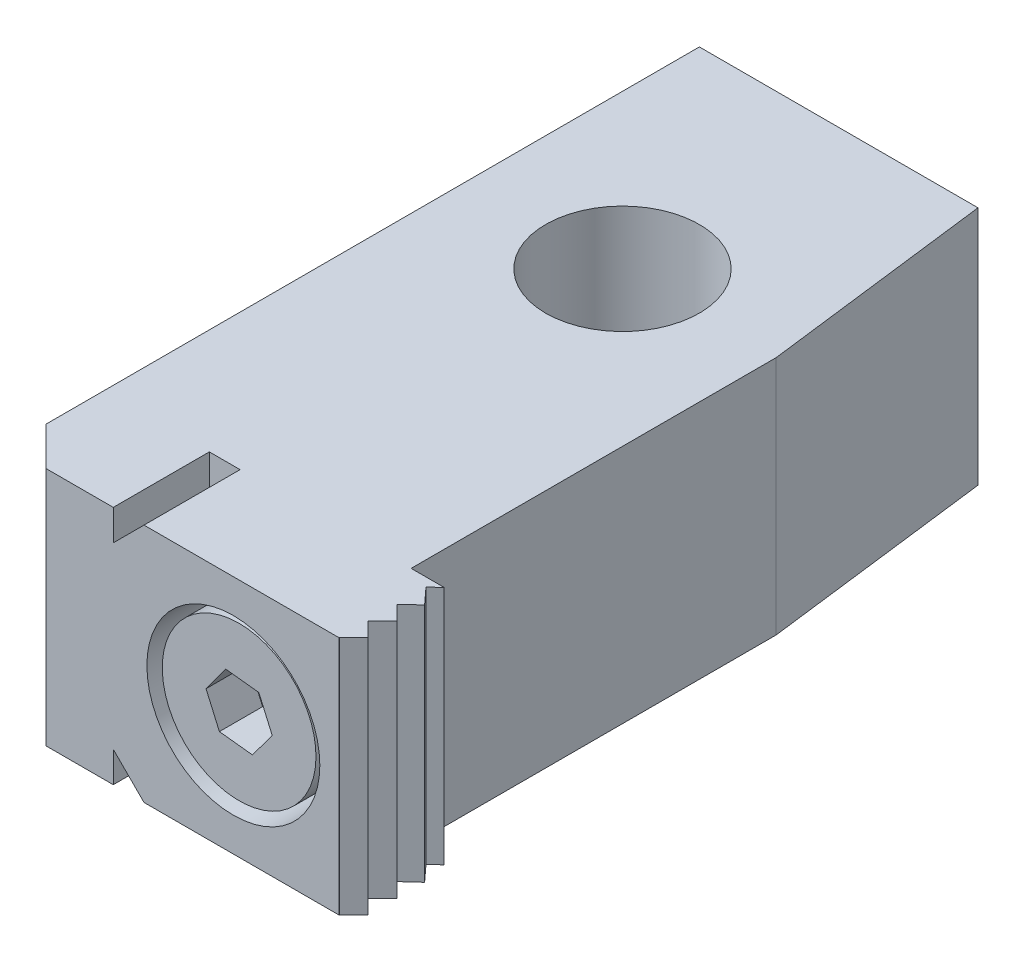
ISO-10303-21;
HEADER;
FILE_DESCRIPTION(('STEP AP214'),'2;1');
FILE_NAME('part.step','',(''),(''),'','','');
FILE_SCHEMA(('AUTOMOTIVE_DESIGN { 1 0 10303 214 1 1 1 1 }'));
ENDSEC;
DATA;
#1=APPLICATION_CONTEXT('core data for automotive mechanical design processes');
#2=APPLICATION_PROTOCOL_DEFINITION('international standard','automotive_design',2000,#1);
#3=PRODUCT_CONTEXT('',#1,'mechanical');
#4=PRODUCT('Part','Part','',(#3));
#5=PRODUCT_RELATED_PRODUCT_CATEGORY('part','',(#4));
#6=PRODUCT_DEFINITION_FORMATION('','',#4);
#7=PRODUCT_DEFINITION_CONTEXT('part definition',#1,'design');
#8=PRODUCT_DEFINITION('design','',#6,#7);
#9=PRODUCT_DEFINITION_SHAPE('','',#8);
#10=(LENGTH_UNIT() NAMED_UNIT(*) SI_UNIT(.MILLI.,.METRE.));
#11=(NAMED_UNIT(*) PLANE_ANGLE_UNIT() SI_UNIT($,.RADIAN.));
#12=(NAMED_UNIT(*) SI_UNIT($,.STERADIAN.) SOLID_ANGLE_UNIT());
#13=UNCERTAINTY_MEASURE_WITH_UNIT(LENGTH_MEASURE(1.E-05),#10,'distance_accuracy_value','');
#14=(GEOMETRIC_REPRESENTATION_CONTEXT(3) GLOBAL_UNCERTAINTY_ASSIGNED_CONTEXT((#13)) GLOBAL_UNIT_ASSIGNED_CONTEXT((#10,
#11,#12)) REPRESENTATION_CONTEXT('',''));
#15=CARTESIAN_POINT('',(0.,0.,0.));
#16=DIRECTION('',(0.,0.,1.));
#17=DIRECTION('',(1.,0.,0.));
#18=AXIS2_PLACEMENT_3D('',#15,#16,#17);
#19=CARTESIAN_POINT('',(8.38549232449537,7.9508429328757,47.4));
#20=DIRECTION('',(0.,0.,1.));
#21=DIRECTION('',(0.110686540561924,0.993855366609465,0.));
#22=AXIS2_PLACEMENT_3D('',#19,#20,#21);
#23=PLANE('',#22);
#24=DIRECTION('',(-0.592785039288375,-0.805360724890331,0.));
#25=VECTOR('',#24,1.);
#26=CARTESIAN_POINT('',(6.11065163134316,3.17328081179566,47.4));
#27=LINE('',#26,#25);
#28=CARTESIAN_POINT('',(6.11065163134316,3.17328081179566,47.4));
#29=VERTEX_POINT('',#28);
#30=CARTESIAN_POINT('',(4.05718401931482,0.38342942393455,47.4));
#31=VERTEX_POINT('',#30);
#32=EDGE_CURVE('E35',#29,#31,#27,.T.);
#33=ORIENTED_EDGE('',*,*,#32,.F.);
#34=DIRECTION('',(-0.993855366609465,0.110686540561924,0.));
#35=VECTOR('',#34,1.);
#36=CARTESIAN_POINT('',(9.55346761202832,2.78985138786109,47.4));
#37=LINE('',#36,#35);
#38=CARTESIAN_POINT('',(9.55346761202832,2.78985138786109,47.4));
#39=VERTEX_POINT('',#38);
#40=EDGE_CURVE('E588',#39,#29,#37,.T.);
#41=ORIENTED_EDGE('',*,*,#40,.F.);
#42=DIRECTION('',(-0.401070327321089,0.916047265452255,0.));
#43=VECTOR('',#42,1.);
#44=CARTESIAN_POINT('',(10.9428159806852,-0.383429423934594,47.4));
#45=LINE('',#44,#43);
#46=CARTESIAN_POINT('',(10.9428159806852,-0.383429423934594,47.4));
#47=VERTEX_POINT('',#46);
#48=EDGE_CURVE('E591',#47,#39,#45,.T.);
#49=ORIENTED_EDGE('',*,*,#48,.F.);
#50=DIRECTION('',(0.592785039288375,0.805360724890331,0.));
#51=VECTOR('',#50,1.);
#52=CARTESIAN_POINT('',(8.88934836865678,-3.1732808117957,47.4));
#53=LINE('',#52,#51);
#54=CARTESIAN_POINT('',(8.88934836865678,-3.1732808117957,47.4));
#55=VERTEX_POINT('',#54);
#56=EDGE_CURVE('E594',#55,#47,#53,.T.);
#57=ORIENTED_EDGE('',*,*,#56,.F.);
#58=DIRECTION('',(0.993855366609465,-0.110686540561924,0.));
#59=VECTOR('',#58,1.);
#60=CARTESIAN_POINT('',(5.4465323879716,-2.78985138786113,47.4));
#61=LINE('',#60,#59);
#62=CARTESIAN_POINT('',(5.4465323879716,-2.78985138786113,47.4));
#63=VERTEX_POINT('',#62);
#64=EDGE_CURVE('E597',#63,#55,#61,.T.);
#65=ORIENTED_EDGE('',*,*,#64,.F.);
#66=DIRECTION('',(0.401070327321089,-0.916047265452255,0.));
#67=VECTOR('',#66,1.);
#68=CARTESIAN_POINT('',(4.05718401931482,0.38342942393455,47.4));
#69=LINE('',#68,#67);
#70=EDGE_CURVE('E600',#31,#63,#69,.T.);
#71=ORIENTED_EDGE('',*,*,#70,.F.);
#72=EDGE_LOOP('',(#33,#41,#49,#57,#65,#71));
#73=FACE_BOUND('',#72,.T.);
#74=CARTESIAN_POINT('',(7.5,0.,47.4));
#75=DIRECTION('',(0.,0.,1.));
#76=DIRECTION('',(0.110686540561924,0.993855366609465,0.));
#77=AXIS2_PLACEMENT_3D('',#74,#75,#76);
#78=CIRCLE('',#77,8.);
#79=CARTESIAN_POINT('',(8.38549232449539,7.9508429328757,47.4));
#80=VERTEX_POINT('',#79);
#81=EDGE_CURVE('E541',#80,#80,#78,.T.);
#82=ORIENTED_EDGE('',*,*,#81,.T.);
#83=EDGE_LOOP('',(#82));
#84=FACE_BOUND('',#83,.T.);
#85=ADVANCED_FACE('F15',(#73,#84),#23,.T.);
#86=CARTESIAN_POINT('',(7.5,0.,41.4));
#87=DIRECTION('',(0.,0.,1.));
#88=DIRECTION('',(0.110686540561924,0.993855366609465,0.));
#89=AXIS2_PLACEMENT_3D('',#86,#87,#88);
#90=CYLINDRICAL_SURFACE('',#89,8.);
#91=CARTESIAN_POINT('',(7.5,0.,41.4));
#92=DIRECTION('',(0.,0.,1.));
#93=DIRECTION('',(0.110686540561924,0.993855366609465,0.));
#94=AXIS2_PLACEMENT_3D('',#91,#92,#93);
#95=CIRCLE('',#94,8.);
#96=CARTESIAN_POINT('',(8.38549232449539,7.9508429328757,41.4));
#97=VERTEX_POINT('',#96);
#98=EDGE_CURVE('E543',#97,#97,#95,.T.);
#99=ORIENTED_EDGE('',*,*,#98,.T.);
#100=EDGE_LOOP('',(#99));
#101=FACE_BOUND('',#100,.T.);
#102=ORIENTED_EDGE('',*,*,#81,.F.);
#103=EDGE_LOOP('',(#102));
#104=FACE_BOUND('',#103,.T.);
#105=ADVANCED_FACE('F452',(#101,#104),#90,.T.);
#106=CARTESIAN_POINT('',(6.11065163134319,3.17328081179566,42.9));
#107=DIRECTION('',(-0.805360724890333,0.592785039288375,0.));
#108=DIRECTION('',(-0.592785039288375,-0.805360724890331,0.));
#109=AXIS2_PLACEMENT_3D('',#106,#107,#108);
#110=PLANE('',#109);
#111=ORIENTED_EDGE('',*,*,#32,.T.);
#112=DIRECTION('',(0.,0.,1.));
#113=VECTOR('',#112,1.);
#114=CARTESIAN_POINT('',(4.05718401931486,0.383429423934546,42.9));
#115=LINE('',#114,#113);
#116=CARTESIAN_POINT('',(4.05718401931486,0.383429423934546,42.9));
#117=VERTEX_POINT('',#116);
#118=EDGE_CURVE('E555',#117,#31,#115,.T.);
#119=ORIENTED_EDGE('',*,*,#118,.F.);
#120=DIRECTION('',(-0.592785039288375,-0.805360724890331,0.));
#121=VECTOR('',#120,1.);
#122=CARTESIAN_POINT('',(6.11065163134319,3.17328081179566,42.9));
#123=LINE('',#122,#121);
#124=CARTESIAN_POINT('',(6.11065163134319,3.17328081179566,42.9));
#125=VERTEX_POINT('',#124);
#126=EDGE_CURVE('E585',#125,#117,#123,.T.);
#127=ORIENTED_EDGE('',*,*,#126,.F.);
#128=DIRECTION('',(0.,0.,1.));
#129=VECTOR('',#128,1.);
#130=CARTESIAN_POINT('',(6.11065163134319,3.17328081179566,42.9));
#131=LINE('',#130,#129);
#132=EDGE_CURVE('E554',#125,#29,#131,.T.);
#133=ORIENTED_EDGE('',*,*,#132,.T.);
#134=EDGE_LOOP('',(#111,#119,#127,#133));
#135=FACE_BOUND('',#134,.T.);
#136=ADVANCED_FACE('F459',(#135),#110,.F.);
#137=CARTESIAN_POINT('',(9.55346761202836,2.78985138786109,42.9));
#138=DIRECTION('',(0.110686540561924,0.993855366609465,0.));
#139=DIRECTION('',(-0.993855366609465,0.110686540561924,0.));
#140=AXIS2_PLACEMENT_3D('',#137,#138,#139);
#141=PLANE('',#140);
#142=ORIENTED_EDGE('',*,*,#40,.T.);
#143=ORIENTED_EDGE('',*,*,#132,.F.);
#144=DIRECTION('',(-0.993855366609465,0.110686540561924,0.));
#145=VECTOR('',#144,1.);
#146=CARTESIAN_POINT('',(9.55346761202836,2.78985138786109,42.9));
#147=LINE('',#146,#145);
#148=CARTESIAN_POINT('',(9.55346761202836,2.78985138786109,42.9));
#149=VERTEX_POINT('',#148);
#150=EDGE_CURVE('E558',#149,#125,#147,.T.);
#151=ORIENTED_EDGE('',*,*,#150,.F.);
#152=DIRECTION('',(0.,0.,1.));
#153=VECTOR('',#152,1.);
#154=CARTESIAN_POINT('',(9.55346761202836,2.78985138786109,42.9));
#155=LINE('',#154,#153);
#156=EDGE_CURVE('E567',#149,#39,#155,.T.);
#157=ORIENTED_EDGE('',*,*,#156,.T.);
#158=EDGE_LOOP('',(#142,#143,#151,#157));
#159=FACE_BOUND('',#158,.T.);
#160=ADVANCED_FACE('F643',(#159),#141,.F.);
#161=CARTESIAN_POINT('',(10.9428159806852,-0.383429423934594,42.9));
#162=DIRECTION('',(0.916047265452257,0.401070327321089,0.));
#163=DIRECTION('',(-0.401070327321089,0.916047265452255,0.));
#164=AXIS2_PLACEMENT_3D('',#161,#162,#163);
#165=PLANE('',#164);
#166=ORIENTED_EDGE('',*,*,#48,.T.);
#167=ORIENTED_EDGE('',*,*,#156,.F.);
#168=DIRECTION('',(-0.401070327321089,0.916047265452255,0.));
#169=VECTOR('',#168,1.);
#170=CARTESIAN_POINT('',(10.9428159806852,-0.383429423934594,42.9));
#171=LINE('',#170,#169);
#172=CARTESIAN_POINT('',(10.9428159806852,-0.383429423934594,42.9));
#173=VERTEX_POINT('',#172);
#174=EDGE_CURVE('E573',#173,#149,#171,.T.);
#175=ORIENTED_EDGE('',*,*,#174,.F.);
#176=DIRECTION('',(0.,0.,1.));
#177=VECTOR('',#176,1.);
#178=CARTESIAN_POINT('',(10.9428159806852,-0.383429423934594,42.9));
#179=LINE('',#178,#177);
#180=EDGE_CURVE('E564',#173,#47,#179,.T.);
#181=ORIENTED_EDGE('',*,*,#180,.T.);
#182=EDGE_LOOP('',(#166,#167,#175,#181));
#183=FACE_BOUND('',#182,.T.);
#184=ADVANCED_FACE('F638',(#183),#165,.F.);
#185=CARTESIAN_POINT('',(8.8893483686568,-3.1732808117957,42.9));
#186=DIRECTION('',(0.805360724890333,-0.592785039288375,0.));
#187=DIRECTION('',(0.592785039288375,0.805360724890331,0.));
#188=AXIS2_PLACEMENT_3D('',#185,#186,#187);
#189=PLANE('',#188);
#190=ORIENTED_EDGE('',*,*,#56,.T.);
#191=ORIENTED_EDGE('',*,*,#180,.F.);
#192=DIRECTION('',(0.592785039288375,0.805360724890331,0.));
#193=VECTOR('',#192,1.);
#194=CARTESIAN_POINT('',(8.8893483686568,-3.1732808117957,42.9));
#195=LINE('',#194,#193);
#196=CARTESIAN_POINT('',(8.8893483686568,-3.1732808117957,42.9));
#197=VERTEX_POINT('',#196);
#198=EDGE_CURVE('E576',#197,#173,#195,.T.);
#199=ORIENTED_EDGE('',*,*,#198,.F.);
#200=DIRECTION('',(0.,0.,1.));
#201=VECTOR('',#200,1.);
#202=CARTESIAN_POINT('',(8.8893483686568,-3.1732808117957,42.9));
#203=LINE('',#202,#201);
#204=EDGE_CURVE('E561',#197,#55,#203,.T.);
#205=ORIENTED_EDGE('',*,*,#204,.T.);
#206=EDGE_LOOP('',(#190,#191,#199,#205));
#207=FACE_BOUND('',#206,.T.);
#208=ADVANCED_FACE('F851',(#207),#189,.F.);
#209=CARTESIAN_POINT('',(5.44653238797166,-2.78985138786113,42.9));
#210=DIRECTION('',(-0.110686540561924,-0.993855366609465,0.));
#211=DIRECTION('',(0.,0.,1.));
#212=AXIS2_PLACEMENT_3D('',#209,#210,#211);
#213=PLANE('',#212);
#214=ORIENTED_EDGE('',*,*,#64,.T.);
#215=ORIENTED_EDGE('',*,*,#204,.F.);
#216=DIRECTION('',(0.993855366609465,-0.110686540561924,0.));
#217=VECTOR('',#216,1.);
#218=CARTESIAN_POINT('',(5.44653238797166,-2.78985138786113,42.9));
#219=LINE('',#218,#217);
#220=CARTESIAN_POINT('',(5.44653238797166,-2.78985138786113,42.9));
#221=VERTEX_POINT('',#220);
#222=EDGE_CURVE('E579',#221,#197,#219,.T.);
#223=ORIENTED_EDGE('',*,*,#222,.F.);
#224=DIRECTION('',(0.,0.,1.));
#225=VECTOR('',#224,1.);
#226=CARTESIAN_POINT('',(5.44653238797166,-2.78985138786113,42.9));
#227=LINE('',#226,#225);
#228=EDGE_CURVE('E557',#221,#63,#227,.T.);
#229=ORIENTED_EDGE('',*,*,#228,.T.);
#230=EDGE_LOOP('',(#214,#215,#223,#229));
#231=FACE_BOUND('',#230,.T.);
#232=ADVANCED_FACE('F617',(#231),#213,.F.);
#233=CARTESIAN_POINT('',(4.05718401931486,0.383429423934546,42.9));
#234=DIRECTION('',(-0.916047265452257,-0.401070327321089,0.));
#235=DIRECTION('',(0.401070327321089,-0.916047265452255,0.));
#236=AXIS2_PLACEMENT_3D('',#233,#234,#235);
#237=PLANE('',#236);
#238=ORIENTED_EDGE('',*,*,#70,.T.);
#239=ORIENTED_EDGE('',*,*,#228,.F.);
#240=DIRECTION('',(0.401070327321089,-0.916047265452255,0.));
#241=VECTOR('',#240,1.);
#242=CARTESIAN_POINT('',(4.05718401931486,0.383429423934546,42.9));
#243=LINE('',#242,#241);
#244=EDGE_CURVE('E582',#117,#221,#243,.T.);
#245=ORIENTED_EDGE('',*,*,#244,.F.);
#246=ORIENTED_EDGE('',*,*,#118,.T.);
#247=EDGE_LOOP('',(#238,#239,#245,#246));
#248=FACE_BOUND('',#247,.T.);
#249=ADVANCED_FACE('F607',(#248),#237,.F.);
#250=CARTESIAN_POINT('',(8.16411924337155,5.96313219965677,42.9));
#251=DIRECTION('',(0.,0.,-1.));
#252=DIRECTION('',(-0.110686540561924,-0.993855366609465,0.));
#253=AXIS2_PLACEMENT_3D('',#250,#251,#252);
#254=PLANE('',#253);
#255=ORIENTED_EDGE('',*,*,#126,.T.);
#256=ORIENTED_EDGE('',*,*,#244,.T.);
#257=ORIENTED_EDGE('',*,*,#222,.T.);
#258=ORIENTED_EDGE('',*,*,#198,.T.);
#259=ORIENTED_EDGE('',*,*,#174,.T.);
#260=ORIENTED_EDGE('',*,*,#150,.T.);
#261=EDGE_LOOP('',(#255,#256,#257,#258,#259,#260));
#262=FACE_BOUND('',#261,.T.);
#263=ADVANCED_FACE('F448',(#262),#254,.F.);
#264=CARTESIAN_POINT('',(0.,-12.5,0.));
#265=DIRECTION('',(0.,1.,0.));
#266=DIRECTION('',(0.,0.,-1.));
#267=AXIS2_PLACEMENT_3D('',#264,#265,#266);
#268=CYLINDRICAL_SURFACE('',#267,8.);
#269=CARTESIAN_POINT('',(0.,-12.5,0.));
#270=DIRECTION('',(0.,-1.,0.));
#271=DIRECTION('',(0.,0.,1.));
#272=AXIS2_PLACEMENT_3D('',#269,#270,#271);
#273=CIRCLE('',#272,8.);
#274=CARTESIAN_POINT('',(0.,-12.5,8.));
#275=VERTEX_POINT('',#274);
#276=EDGE_CURVE('E356',#275,#275,#273,.T.);
#277=ORIENTED_EDGE('',*,*,#276,.T.);
#278=EDGE_LOOP('',(#277));
#279=FACE_BOUND('',#278,.T.);
#280=CARTESIAN_POINT('',(0.,12.5,0.));
#281=DIRECTION('',(0.,-1.,0.));
#282=DIRECTION('',(0.,0.,1.));
#283=AXIS2_PLACEMENT_3D('',#280,#281,#282);
#284=CIRCLE('',#283,8.);
#285=CARTESIAN_POINT('',(0.,12.5,8.));
#286=VERTEX_POINT('',#285);
#287=EDGE_CURVE('E352',#286,#286,#284,.T.);
#288=ORIENTED_EDGE('',*,*,#287,.F.);
#289=EDGE_LOOP('',(#288));
#290=FACE_BOUND('',#289,.T.);
#291=ADVANCED_FACE('F442',(#279,#290),#268,.F.);
#292=CARTESIAN_POINT('',(-16.,-12.5,-24.));
#293=DIRECTION('',(1.,0.,0.));
#294=DIRECTION('',(0.,0.,1.));
#295=AXIS2_PLACEMENT_3D('',#292,#293,#294);
#296=PLANE('',#295);
#297=DIRECTION('',(0.,0.,-1.));
#298=VECTOR('',#297,1.);
#299=CARTESIAN_POINT('',(-16.,-12.5,-24.));
#300=LINE('',#299,#298);
#301=CARTESIAN_POINT('',(-16.,-12.5,44.));
#302=VERTEX_POINT('',#301);
#303=CARTESIAN_POINT('',(-16.,-12.5,-24.));
#304=VERTEX_POINT('',#303);
#305=EDGE_CURVE('E201',#302,#304,#300,.T.);
#306=ORIENTED_EDGE('',*,*,#305,.F.);
#307=DIRECTION('',(0.,1.,0.));
#308=VECTOR('',#307,1.);
#309=CARTESIAN_POINT('',(-16.,-12.5,44.));
#310=LINE('',#309,#308);
#311=CARTESIAN_POINT('',(-16.,12.5,44.));
#312=VERTEX_POINT('',#311);
#313=EDGE_CURVE('E205',#302,#312,#310,.T.);
#314=ORIENTED_EDGE('',*,*,#313,.T.);
#315=DIRECTION('',(0.,0.,-1.));
#316=VECTOR('',#315,1.);
#317=CARTESIAN_POINT('',(-16.,12.5,-24.));
#318=LINE('',#317,#316);
#319=CARTESIAN_POINT('',(-16.,12.5,-24.));
#320=VERTEX_POINT('',#319);
#321=EDGE_CURVE('E364',#312,#320,#318,.T.);
#322=ORIENTED_EDGE('',*,*,#321,.T.);
#323=DIRECTION('',(0.,1.,0.));
#324=VECTOR('',#323,1.);
#325=CARTESIAN_POINT('',(-16.,-12.5,-24.));
#326=LINE('',#325,#324);
#327=EDGE_CURVE('E203',#304,#320,#326,.T.);
#328=ORIENTED_EDGE('',*,*,#327,.F.);
#329=EDGE_LOOP('',(#306,#314,#322,#328));
#330=FACE_BOUND('',#329,.T.);
#331=ADVANCED_FACE('F376',(#330),#296,.F.);
#332=CARTESIAN_POINT('',(16.,-12.5,-24.));
#333=DIRECTION('',(0.,0.,1.));
#334=DIRECTION('',(-1.,0.,0.));
#335=AXIS2_PLACEMENT_3D('',#332,#333,#334);
#336=PLANE('',#335);
#337=DIRECTION('',(1.,0.,0.));
#338=VECTOR('',#337,1.);
#339=CARTESIAN_POINT('',(16.,12.5,-24.));
#340=LINE('',#339,#338);
#341=CARTESIAN_POINT('',(13.,12.5,-24.));
#342=VERTEX_POINT('',#341);
#343=EDGE_CURVE('E194',#320,#342,#340,.T.);
#344=ORIENTED_EDGE('',*,*,#343,.T.);
#345=DIRECTION('',(0.,-1.,0.));
#346=VECTOR('',#345,1.);
#347=CARTESIAN_POINT('',(13.,12.5,-24.));
#348=LINE('',#347,#346);
#349=CARTESIAN_POINT('',(13.,-12.5,-24.));
#350=VERTEX_POINT('',#349);
#351=EDGE_CURVE('E176',#342,#350,#348,.T.);
#352=ORIENTED_EDGE('',*,*,#351,.T.);
#353=DIRECTION('',(1.,0.,0.));
#354=VECTOR('',#353,1.);
#355=CARTESIAN_POINT('',(16.,-12.5,-24.));
#356=LINE('',#355,#354);
#357=EDGE_CURVE('E192',#304,#350,#356,.T.);
#358=ORIENTED_EDGE('',*,*,#357,.F.);
#359=ORIENTED_EDGE('',*,*,#327,.T.);
#360=EDGE_LOOP('',(#344,#352,#358,#359));
#361=FACE_BOUND('',#360,.T.);
#362=ADVANCED_FACE('F190',(#361),#336,.F.);
#363=CARTESIAN_POINT('',(13.,12.5,-24.));
#364=DIRECTION('',(-0.992277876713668,0.,0.124034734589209));
#365=DIRECTION('',(-0.124034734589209,0.,-0.992277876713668));
#366=AXIS2_PLACEMENT_3D('',#363,#364,#365);
#367=PLANE('',#366);
#368=DIRECTION('',(-0.124034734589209,0.,-0.992277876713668));
#369=VECTOR('',#368,1.);
#370=CARTESIAN_POINT('',(13.,-12.5,-24.));
#371=LINE('',#370,#369);
#372=CARTESIAN_POINT('',(16.,-12.5,0.));
#373=VERTEX_POINT('',#372);
#374=EDGE_CURVE('E173',#373,#350,#371,.T.);
#375=ORIENTED_EDGE('',*,*,#374,.T.);
#376=ORIENTED_EDGE('',*,*,#351,.F.);
#377=DIRECTION('',(-0.124034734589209,0.,-0.992277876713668));
#378=VECTOR('',#377,1.);
#379=CARTESIAN_POINT('',(13.,12.5,-24.));
#380=LINE('',#379,#378);
#381=CARTESIAN_POINT('',(16.,12.5,0.));
#382=VERTEX_POINT('',#381);
#383=EDGE_CURVE('E184',#382,#342,#380,.T.);
#384=ORIENTED_EDGE('',*,*,#383,.F.);
#385=DIRECTION('',(0.,-1.,0.));
#386=VECTOR('',#385,1.);
#387=CARTESIAN_POINT('',(16.,12.5,0.));
#388=LINE('',#387,#386);
#389=EDGE_CURVE('E179',#382,#373,#388,.T.);
#390=ORIENTED_EDGE('',*,*,#389,.T.);
#391=EDGE_LOOP('',(#375,#376,#384,#390));
#392=FACE_BOUND('',#391,.T.);
#393=ADVANCED_FACE('F175',(#392),#367,.F.);
#394=CARTESIAN_POINT('',(16.,-12.5,-24.));
#395=DIRECTION('',(-1.,0.,0.));
#396=DIRECTION('',(0.,0.,-1.));
#397=AXIS2_PLACEMENT_3D('',#394,#395,#396);
#398=PLANE('',#397);
#399=DIRECTION('',(0.,0.,1.));
#400=VECTOR('',#399,1.);
#401=CARTESIAN_POINT('',(16.,-12.5,-24.));
#402=LINE('',#401,#400);
#403=CARTESIAN_POINT('',(16.,-12.5,38.));
#404=VERTEX_POINT('',#403);
#405=EDGE_CURVE('E367',#373,#404,#402,.T.);
#406=ORIENTED_EDGE('',*,*,#405,.F.);
#407=ORIENTED_EDGE('',*,*,#389,.F.);
#408=DIRECTION('',(0.,0.,1.));
#409=VECTOR('',#408,1.);
#410=CARTESIAN_POINT('',(16.,12.5,-24.));
#411=LINE('',#410,#409);
#412=CARTESIAN_POINT('',(16.,12.5,38.));
#413=VERTEX_POINT('',#412);
#414=EDGE_CURVE('E359',#382,#413,#411,.T.);
#415=ORIENTED_EDGE('',*,*,#414,.T.);
#416=DIRECTION('',(0.,1.,0.));
#417=VECTOR('',#416,1.);
#418=CARTESIAN_POINT('',(16.,-12.5,38.));
#419=LINE('',#418,#417);
#420=EDGE_CURVE('E324',#404,#413,#419,.T.);
#421=ORIENTED_EDGE('',*,*,#420,.F.);
#422=EDGE_LOOP('',(#406,#407,#415,#421));
#423=FACE_BOUND('',#422,.T.);
#424=ADVANCED_FACE('F17',(#423),#398,.F.);
#425=CARTESIAN_POINT('',(16.,12.5,38.));
#426=DIRECTION('',(0.,0.,1.));
#427=DIRECTION('',(-1.,0.,0.));
#428=AXIS2_PLACEMENT_3D('',#425,#426,#427);
#429=PLANE('',#428);
#430=DIRECTION('',(0.70710678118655,-0.707106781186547,0.));
#431=VECTOR('',#430,1.);
#432=CARTESIAN_POINT('',(-1.8,-12.5,38.));
#433=LINE('',#432,#431);
#434=CARTESIAN_POINT('',(-5.,-9.3,38.));
#435=VERTEX_POINT('',#434);
#436=CARTESIAN_POINT('',(-1.8,-12.5,38.));
#437=VERTEX_POINT('',#436);
#438=EDGE_CURVE('E301',#435,#437,#433,.T.);
#439=ORIENTED_EDGE('',*,*,#438,.F.);
#440=DIRECTION('',(0.,-1.,0.));
#441=VECTOR('',#440,1.);
#442=CARTESIAN_POINT('',(-5.,-12.5,38.));
#443=LINE('',#442,#441);
#444=CARTESIAN_POINT('',(-5.,-12.5,38.));
#445=VERTEX_POINT('',#444);
#446=EDGE_CURVE('E341',#435,#445,#443,.T.);
#447=ORIENTED_EDGE('',*,*,#446,.T.);
#448=DIRECTION('',(1.,0.,0.));
#449=VECTOR('',#448,1.);
#450=CARTESIAN_POINT('',(16.,-12.5,38.));
#451=LINE('',#450,#449);
#452=EDGE_CURVE('E345',#445,#437,#451,.T.);
#453=ORIENTED_EDGE('',*,*,#452,.T.);
#454=EDGE_LOOP('',(#439,#447,#453));
#455=FACE_BOUND('',#454,.T.);
#456=ADVANCED_FACE('F427',(#455),#429,.T.);
#457=CARTESIAN_POINT('',(-5.,-12.5,38.));
#458=DIRECTION('',(-1.,0.,0.));
#459=DIRECTION('',(0.,-1.,0.));
#460=AXIS2_PLACEMENT_3D('',#457,#458,#459);
#461=PLANE('',#460);
#462=ORIENTED_EDGE('',*,*,#446,.F.);
#463=DIRECTION('',(0.,0.,-1.));
#464=VECTOR('',#463,1.);
#465=CARTESIAN_POINT('',(-5.,-9.3,48.));
#466=LINE('',#465,#464);
#467=CARTESIAN_POINT('',(-5.,-9.3,48.));
#468=VERTEX_POINT('',#467);
#469=EDGE_CURVE('E317',#468,#435,#466,.T.);
#470=ORIENTED_EDGE('',*,*,#469,.F.);
#471=DIRECTION('',(0.,-1.,0.));
#472=VECTOR('',#471,1.);
#473=CARTESIAN_POINT('',(-5.,-12.5,48.));
#474=LINE('',#473,#472);
#475=CARTESIAN_POINT('',(-5.,-12.5,48.));
#476=VERTEX_POINT('',#475);
#477=EDGE_CURVE('E195',#468,#476,#474,.T.);
#478=ORIENTED_EDGE('',*,*,#477,.T.);
#479=DIRECTION('',(0.,0.,1.));
#480=VECTOR('',#479,1.);
#481=CARTESIAN_POINT('',(-5.,-12.5,38.));
#482=LINE('',#481,#480);
#483=EDGE_CURVE('E349',#445,#476,#482,.T.);
#484=ORIENTED_EDGE('',*,*,#483,.F.);
#485=EDGE_LOOP('',(#462,#470,#478,#484));
#486=FACE_BOUND('',#485,.T.);
#487=ADVANCED_FACE('F430',(#486),#461,.F.);
#488=CARTESIAN_POINT('',(-16.,-12.5,44.));
#489=DIRECTION('',(0.707106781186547,0.,-0.707106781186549));
#490=DIRECTION('',(0.707106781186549,0.,0.707106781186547));
#491=AXIS2_PLACEMENT_3D('',#488,#489,#490);
#492=PLANE('',#491);
#493=DIRECTION('',(0.707106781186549,0.,0.707106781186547));
#494=VECTOR('',#493,1.);
#495=CARTESIAN_POINT('',(2.,-12.5,62.));
#496=LINE('',#495,#494);
#497=CARTESIAN_POINT('',(-12.,-12.5,48.));
#498=VERTEX_POINT('',#497);
#499=EDGE_CURVE('E19',#498,#302,#496,.F.);
#500=ORIENTED_EDGE('',*,*,#499,.F.);
#501=DIRECTION('',(0.,-1.,0.));
#502=VECTOR('',#501,1.);
#503=CARTESIAN_POINT('',(-12.,-12.5,48.));
#504=LINE('',#503,#502);
#505=CARTESIAN_POINT('',(-12.,12.5,48.));
#506=VERTEX_POINT('',#505);
#507=EDGE_CURVE('E168',#506,#498,#504,.T.);
#508=ORIENTED_EDGE('',*,*,#507,.F.);
#509=DIRECTION('',(-0.707106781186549,0.,-0.707106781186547));
#510=VECTOR('',#509,1.);
#511=CARTESIAN_POINT('',(-16.,12.5,44.));
#512=LINE('',#511,#510);
#513=EDGE_CURVE('E213',#312,#506,#512,.F.);
#514=ORIENTED_EDGE('',*,*,#513,.F.);
#515=ORIENTED_EDGE('',*,*,#313,.F.);
#516=EDGE_LOOP('',(#500,#508,#514,#515));
#517=FACE_BOUND('',#516,.T.);
#518=ADVANCED_FACE('F373',(#517),#492,.F.);
#519=CARTESIAN_POINT('',(-5.,12.5,48.));
#520=VERTEX_POINT('',#519);
#521=CARTESIAN_POINT('',(-5.,9.3,48.));
#522=VERTEX_POINT('',#521);
#523=EDGE_CURVE('E335',#520,#522,#474,.T.);
#524=ORIENTED_EDGE('',*,*,#523,.T.);
#525=DIRECTION('',(0.,0.,-1.));
#526=VECTOR('',#525,1.);
#527=CARTESIAN_POINT('',(-5.,9.3,48.));
#528=LINE('',#527,#526);
#529=CARTESIAN_POINT('',(-5.,9.3,38.));
#530=VERTEX_POINT('',#529);
#531=EDGE_CURVE('E319',#522,#530,#528,.T.);
#532=ORIENTED_EDGE('',*,*,#531,.T.);
#533=CARTESIAN_POINT('',(-5.,12.5,38.));
#534=VERTEX_POINT('',#533);
#535=EDGE_CURVE('E342',#534,#530,#443,.T.);
#536=ORIENTED_EDGE('',*,*,#535,.F.);
#537=DIRECTION('',(0.,0.,1.));
#538=VECTOR('',#537,1.);
#539=CARTESIAN_POINT('',(-5.,12.5,38.));
#540=LINE('',#539,#538);
#541=EDGE_CURVE('E348',#534,#520,#540,.T.);
#542=ORIENTED_EDGE('',*,*,#541,.T.);
#543=EDGE_LOOP('',(#524,#532,#536,#542));
#544=FACE_BOUND('',#543,.T.);
#545=ADVANCED_FACE('F433',(#544),#461,.F.);
#546=DIRECTION('',(-0.70710678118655,-0.707106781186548,0.));
#547=VECTOR('',#546,1.);
#548=CARTESIAN_POINT('',(-5.,9.3,38.));
#549=LINE('',#548,#547);
#550=CARTESIAN_POINT('',(-1.8,12.5,38.));
#551=VERTEX_POINT('',#550);
#552=EDGE_CURVE('E298',#551,#530,#549,.T.);
#553=ORIENTED_EDGE('',*,*,#552,.F.);
#554=DIRECTION('',(-1.,0.,0.));
#555=VECTOR('',#554,1.);
#556=CARTESIAN_POINT('',(16.,12.5,38.));
#557=LINE('',#556,#555);
#558=EDGE_CURVE('E338',#551,#534,#557,.T.);
#559=ORIENTED_EDGE('',*,*,#558,.T.);
#560=ORIENTED_EDGE('',*,*,#535,.T.);
#561=EDGE_LOOP('',(#553,#559,#560));
#562=FACE_BOUND('',#561,.T.);
#563=ADVANCED_FACE('F434',(#562),#429,.T.);
#564=CARTESIAN_POINT('',(18.5,-12.5,41.9674088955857));
#565=DIRECTION('',(-0.674731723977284,0.,-0.738063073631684));
#566=DIRECTION('',(0.738063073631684,0.,-0.674731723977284));
#567=AXIS2_PLACEMENT_3D('',#564,#565,#566);
#568=PLANE('',#567);
#569=DIRECTION('',(-0.738063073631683,0.,0.674731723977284));
#570=VECTOR('',#569,1.);
#571=CARTESIAN_POINT('',(18.5,12.5,41.9674088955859));
#572=LINE('',#571,#570);
#573=CARTESIAN_POINT('',(20.,12.5,40.5961201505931));
#574=VERTEX_POINT('',#573);
#575=CARTESIAN_POINT('',(18.5,12.5,41.9674088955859));
#576=VERTEX_POINT('',#575);
#577=EDGE_CURVE('E214',#574,#576,#572,.T.);
#578=ORIENTED_EDGE('',*,*,#577,.T.);
#579=DIRECTION('',(0.,1.,0.));
#580=VECTOR('',#579,1.);
#581=CARTESIAN_POINT('',(18.5,-12.5,41.9674088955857));
#582=LINE('',#581,#580);
#583=CARTESIAN_POINT('',(18.5,-12.5,41.9674088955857));
#584=VERTEX_POINT('',#583);
#585=EDGE_CURVE('E267',#584,#576,#582,.T.);
#586=ORIENTED_EDGE('',*,*,#585,.F.);
#587=DIRECTION('',(-0.738063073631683,0.,0.674731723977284));
#588=VECTOR('',#587,1.);
#589=CARTESIAN_POINT('',(18.5,-12.5,41.9674088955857));
#590=LINE('',#589,#588);
#591=CARTESIAN_POINT('',(20.,-12.5,40.5961201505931));
#592=VERTEX_POINT('',#591);
#593=EDGE_CURVE('E243',#592,#584,#590,.T.);
#594=ORIENTED_EDGE('',*,*,#593,.F.);
#595=DIRECTION('',(0.,1.,0.));
#596=VECTOR('',#595,1.);
#597=CARTESIAN_POINT('',(20.,-12.5,40.5961201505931));
#598=LINE('',#597,#596);
#599=EDGE_CURVE('E268',#592,#574,#598,.T.);
#600=ORIENTED_EDGE('',*,*,#599,.T.);
#601=EDGE_LOOP('',(#578,#586,#594,#600));
#602=FACE_BOUND('',#601,.T.);
#603=ADVANCED_FACE('F398',(#602),#568,.F.);
#604=CARTESIAN_POINT('',(20.,-12.5,43.4674088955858));
#605=DIRECTION('',(-0.707106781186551,0.,0.707106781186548));
#606=DIRECTION('',(-0.707106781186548,0.,-0.707106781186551));
#607=AXIS2_PLACEMENT_3D('',#604,#605,#606);
#608=PLANE('',#607);
#609=DIRECTION('',(0.707106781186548,0.,0.707106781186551));
#610=VECTOR('',#609,1.);
#611=CARTESIAN_POINT('',(20.,12.5,43.4674088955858));
#612=LINE('',#611,#610);
#613=CARTESIAN_POINT('',(20.,12.5,43.4674088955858));
#614=VERTEX_POINT('',#613);
#615=EDGE_CURVE('E217',#576,#614,#612,.T.);
#616=ORIENTED_EDGE('',*,*,#615,.T.);
#617=DIRECTION('',(0.,1.,0.));
#618=VECTOR('',#617,1.);
#619=CARTESIAN_POINT('',(20.,-12.5,43.4674088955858));
#620=LINE('',#619,#618);
#621=CARTESIAN_POINT('',(20.,-12.5,43.4674088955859));
#622=VERTEX_POINT('',#621);
#623=EDGE_CURVE('E284',#622,#614,#620,.T.);
#624=ORIENTED_EDGE('',*,*,#623,.F.);
#625=DIRECTION('',(0.707106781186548,0.,0.707106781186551));
#626=VECTOR('',#625,1.);
#627=CARTESIAN_POINT('',(20.,-12.5,43.4674088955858));
#628=LINE('',#627,#626);
#629=EDGE_CURVE('E246',#584,#622,#628,.T.);
#630=ORIENTED_EDGE('',*,*,#629,.F.);
#631=ORIENTED_EDGE('',*,*,#585,.T.);
#632=EDGE_LOOP('',(#616,#624,#630,#631));
#633=FACE_BOUND('',#632,.T.);
#634=ADVANCED_FACE('F401',(#633),#608,.F.);
#635=CARTESIAN_POINT('',(18.5,-12.5,44.9674088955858));
#636=DIRECTION('',(-0.707106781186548,0.,-0.707106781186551));
#637=DIRECTION('',(0.707106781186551,0.,-0.707106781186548));
#638=AXIS2_PLACEMENT_3D('',#635,#636,#637);
#639=PLANE('',#638);
#640=DIRECTION('',(-0.707106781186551,0.,0.707106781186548));
#641=VECTOR('',#640,1.);
#642=CARTESIAN_POINT('',(18.5,12.5,44.9674088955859));
#643=LINE('',#642,#641);
#644=CARTESIAN_POINT('',(18.5,12.5,44.9674088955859));
#645=VERTEX_POINT('',#644);
#646=EDGE_CURVE('E223',#614,#645,#643,.T.);
#647=ORIENTED_EDGE('',*,*,#646,.T.);
#648=DIRECTION('',(0.,1.,0.));
#649=VECTOR('',#648,1.);
#650=CARTESIAN_POINT('',(18.5,-12.5,44.9674088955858));
#651=LINE('',#650,#649);
#652=CARTESIAN_POINT('',(18.5,-12.5,44.9674088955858));
#653=VERTEX_POINT('',#652);
#654=EDGE_CURVE('E282',#653,#645,#651,.T.);
#655=ORIENTED_EDGE('',*,*,#654,.F.);
#656=DIRECTION('',(-0.707106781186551,0.,0.707106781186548));
#657=VECTOR('',#656,1.);
#658=CARTESIAN_POINT('',(18.5,-12.5,44.9674088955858));
#659=LINE('',#658,#657);
#660=EDGE_CURVE('E249',#622,#653,#659,.T.);
#661=ORIENTED_EDGE('',*,*,#660,.F.);
#662=ORIENTED_EDGE('',*,*,#623,.T.);
#663=EDGE_LOOP('',(#647,#655,#661,#662));
#664=FACE_BOUND('',#663,.T.);
#665=ADVANCED_FACE('F404',(#664),#639,.F.);
#666=CARTESIAN_POINT('',(20.,-12.5,46.4674088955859));
#667=DIRECTION('',(-0.70710678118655,0.,0.707106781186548));
#668=DIRECTION('',(-0.707106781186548,0.,-0.70710678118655));
#669=AXIS2_PLACEMENT_3D('',#666,#667,#668);
#670=PLANE('',#669);
#671=DIRECTION('',(0.707106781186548,0.,0.70710678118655));
#672=VECTOR('',#671,1.);
#673=CARTESIAN_POINT('',(20.,12.5,46.4674088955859));
#674=LINE('',#673,#672);
#675=CARTESIAN_POINT('',(20.,12.5,46.4674088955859));
#676=VERTEX_POINT('',#675);
#677=EDGE_CURVE('E229',#645,#676,#674,.T.);
#678=ORIENTED_EDGE('',*,*,#677,.T.);
#679=DIRECTION('',(0.,1.,0.));
#680=VECTOR('',#679,1.);
#681=CARTESIAN_POINT('',(20.,-12.5,46.4674088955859));
#682=LINE('',#681,#680);
#683=CARTESIAN_POINT('',(20.,-12.5,46.4674088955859));
#684=VERTEX_POINT('',#683);
#685=EDGE_CURVE('E280',#684,#676,#682,.T.);
#686=ORIENTED_EDGE('',*,*,#685,.F.);
#687=DIRECTION('',(0.707106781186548,0.,0.70710678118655));
#688=VECTOR('',#687,1.);
#689=CARTESIAN_POINT('',(20.,-12.5,46.4674088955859));
#690=LINE('',#689,#688);
#691=EDGE_CURVE('E252',#653,#684,#690,.T.);
#692=ORIENTED_EDGE('',*,*,#691,.F.);
#693=ORIENTED_EDGE('',*,*,#654,.T.);
#694=EDGE_LOOP('',(#678,#686,#692,#693));
#695=FACE_BOUND('',#694,.T.);
#696=ADVANCED_FACE('F409',(#695),#670,.F.);
#697=CARTESIAN_POINT('',(20.,12.5,38.));
#698=DIRECTION('',(0.,0.,1.));
#699=DIRECTION('',(-1.,0.,0.));
#700=AXIS2_PLACEMENT_3D('',#697,#698,#699);
#701=PLANE('',#700);
#702=DIRECTION('',(1.,0.,0.));
#703=VECTOR('',#702,1.);
#704=CARTESIAN_POINT('',(20.,-12.5,38.));
#705=LINE('',#704,#703);
#706=CARTESIAN_POINT('',(19.4474616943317,-12.5,38.));
#707=VERTEX_POINT('',#706);
#708=EDGE_CURVE('E303',#404,#707,#705,.T.);
#709=ORIENTED_EDGE('',*,*,#708,.F.);
#710=ORIENTED_EDGE('',*,*,#420,.T.);
#711=DIRECTION('',(-1.,0.,0.));
#712=VECTOR('',#711,1.);
#713=CARTESIAN_POINT('',(20.,12.5,38.));
#714=LINE('',#713,#712);
#715=CARTESIAN_POINT('',(19.4474616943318,12.5,38.));
#716=VERTEX_POINT('',#715);
#717=EDGE_CURVE('E295',#716,#413,#714,.T.);
#718=ORIENTED_EDGE('',*,*,#717,.F.);
#719=DIRECTION('',(0.,1.,0.));
#720=VECTOR('',#719,1.);
#721=CARTESIAN_POINT('',(19.4474616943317,-12.5,38.));
#722=LINE('',#721,#720);
#723=EDGE_CURVE('E273',#707,#716,#722,.T.);
#724=ORIENTED_EDGE('',*,*,#723,.F.);
#725=EDGE_LOOP('',(#709,#710,#718,#724));
#726=FACE_BOUND('',#725,.T.);
#727=ADVANCED_FACE('F388',(#726),#701,.F.);
#728=CARTESIAN_POINT('',(18.4555960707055,-12.5,38.906756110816));
#729=DIRECTION('',(-0.674731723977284,0.,-0.738063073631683));
#730=DIRECTION('',(0.738063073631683,0.,-0.674731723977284));
#731=AXIS2_PLACEMENT_3D('',#728,#729,#730);
#732=PLANE('',#731);
#733=DIRECTION('',(-0.738063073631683,0.,0.674731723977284));
#734=VECTOR('',#733,1.);
#735=CARTESIAN_POINT('',(18.4555960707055,12.5,38.9067561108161));
#736=LINE('',#735,#734);
#737=CARTESIAN_POINT('',(18.4555960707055,12.5,38.9067561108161));
#738=VERTEX_POINT('',#737);
#739=EDGE_CURVE('E237',#716,#738,#736,.T.);
#740=ORIENTED_EDGE('',*,*,#739,.T.);
#741=DIRECTION('',(0.,1.,0.));
#742=VECTOR('',#741,1.);
#743=CARTESIAN_POINT('',(18.4555960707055,-12.5,38.906756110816));
#744=LINE('',#743,#742);
#745=CARTESIAN_POINT('',(18.4555960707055,-12.5,38.906756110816));
#746=VERTEX_POINT('',#745);
#747=EDGE_CURVE('E271',#746,#738,#744,.T.);
#748=ORIENTED_EDGE('',*,*,#747,.F.);
#749=DIRECTION('',(-0.738063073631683,0.,0.674731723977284));
#750=VECTOR('',#749,1.);
#751=CARTESIAN_POINT('',(18.4555960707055,-12.5,38.906756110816));
#752=LINE('',#751,#750);
#753=EDGE_CURVE('E261',#707,#746,#752,.T.);
#754=ORIENTED_EDGE('',*,*,#753,.F.);
#755=ORIENTED_EDGE('',*,*,#723,.T.);
#756=EDGE_LOOP('',(#740,#748,#754,#755));
#757=FACE_BOUND('',#756,.T.);
#758=ADVANCED_FACE('F392',(#757),#732,.F.);
#759=CARTESIAN_POINT('',(20.,-12.5,40.5961201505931));
#760=DIRECTION('',(-0.738063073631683,0.,0.674731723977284));
#761=DIRECTION('',(-0.674731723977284,0.,-0.738063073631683));
#762=AXIS2_PLACEMENT_3D('',#759,#760,#761);
#763=PLANE('',#762);
#764=DIRECTION('',(0.674731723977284,0.,0.738063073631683));
#765=VECTOR('',#764,1.);
#766=CARTESIAN_POINT('',(20.,12.5,40.5961201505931));
#767=LINE('',#766,#765);
#768=EDGE_CURVE('E240',#738,#574,#767,.T.);
#769=ORIENTED_EDGE('',*,*,#768,.T.);
#770=ORIENTED_EDGE('',*,*,#599,.F.);
#771=DIRECTION('',(0.674731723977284,0.,0.738063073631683));
#772=VECTOR('',#771,1.);
#773=CARTESIAN_POINT('',(20.,-12.5,40.5961201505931));
#774=LINE('',#773,#772);
#775=EDGE_CURVE('E264',#746,#592,#774,.T.);
#776=ORIENTED_EDGE('',*,*,#775,.F.);
#777=ORIENTED_EDGE('',*,*,#747,.T.);
#778=EDGE_LOOP('',(#769,#770,#776,#777));
#779=FACE_BOUND('',#778,.T.);
#780=ADVANCED_FACE('F394',(#779),#763,.F.);
#781=CARTESIAN_POINT('',(18.5,-12.5,47.9674088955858));
#782=DIRECTION('',(-0.707106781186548,0.,-0.707106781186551));
#783=DIRECTION('',(0.707106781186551,0.,-0.707106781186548));
#784=AXIS2_PLACEMENT_3D('',#781,#782,#783);
#785=PLANE('',#784);
#786=DIRECTION('',(-0.707106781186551,0.,0.707106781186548));
#787=VECTOR('',#786,1.);
#788=CARTESIAN_POINT('',(18.5,12.5,47.9674088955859));
#789=LINE('',#788,#787);
#790=CARTESIAN_POINT('',(18.5,12.5,47.9674088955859));
#791=VERTEX_POINT('',#790);
#792=EDGE_CURVE('E232',#676,#791,#789,.T.);
#793=ORIENTED_EDGE('',*,*,#792,.T.);
#794=DIRECTION('',(0.,1.,0.));
#795=VECTOR('',#794,1.);
#796=CARTESIAN_POINT('',(18.5,-12.5,47.9674088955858));
#797=LINE('',#796,#795);
#798=CARTESIAN_POINT('',(18.5,-12.5,47.9674088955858));
#799=VERTEX_POINT('',#798);
#800=EDGE_CURVE('E278',#799,#791,#797,.T.);
#801=ORIENTED_EDGE('',*,*,#800,.F.);
#802=DIRECTION('',(-0.707106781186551,0.,0.707106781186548));
#803=VECTOR('',#802,1.);
#804=CARTESIAN_POINT('',(18.5,-12.5,47.9674088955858));
#805=LINE('',#804,#803);
#806=EDGE_CURVE('E255',#684,#799,#805,.T.);
#807=ORIENTED_EDGE('',*,*,#806,.F.);
#808=ORIENTED_EDGE('',*,*,#685,.T.);
#809=EDGE_LOOP('',(#793,#801,#807,#808));
#810=FACE_BOUND('',#809,.T.);
#811=ADVANCED_FACE('F412',(#810),#785,.F.);
#812=CARTESIAN_POINT('',(20.,-12.5,48.));
#813=DIRECTION('',(0.,1.,0.));
#814=DIRECTION('',(0.,0.,-1.));
#815=AXIS2_PLACEMENT_3D('',#812,#813,#814);
#816=PLANE('',#815);
#817=DIRECTION('',(0.,0.,-1.));
#818=VECTOR('',#817,1.);
#819=CARTESIAN_POINT('',(-1.8,-12.5,48.));
#820=LINE('',#819,#818);
#821=CARTESIAN_POINT('',(-1.8,-12.5,48.));
#822=VERTEX_POINT('',#821);
#823=EDGE_CURVE('E315',#822,#437,#820,.T.);
#824=ORIENTED_EDGE('',*,*,#823,.T.);
#825=ORIENTED_EDGE('',*,*,#452,.F.);
#826=ORIENTED_EDGE('',*,*,#483,.T.);
#827=DIRECTION('',(-1.,0.,0.));
#828=VECTOR('',#827,1.);
#829=CARTESIAN_POINT('',(16.,-12.5,48.));
#830=LINE('',#829,#828);
#831=EDGE_CURVE('E207',#476,#498,#830,.T.);
#832=ORIENTED_EDGE('',*,*,#831,.T.);
#833=ORIENTED_EDGE('',*,*,#499,.T.);
#834=ORIENTED_EDGE('',*,*,#305,.T.);
#835=ORIENTED_EDGE('',*,*,#357,.T.);
#836=ORIENTED_EDGE('',*,*,#374,.F.);
#837=ORIENTED_EDGE('',*,*,#405,.T.);
#838=ORIENTED_EDGE('',*,*,#708,.T.);
#839=ORIENTED_EDGE('',*,*,#753,.T.);
#840=ORIENTED_EDGE('',*,*,#775,.T.);
#841=ORIENTED_EDGE('',*,*,#593,.T.);
#842=ORIENTED_EDGE('',*,*,#629,.T.);
#843=ORIENTED_EDGE('',*,*,#660,.T.);
#844=ORIENTED_EDGE('',*,*,#691,.T.);
#845=ORIENTED_EDGE('',*,*,#806,.T.);
#846=DIRECTION('',(0.,0.,1.));
#847=VECTOR('',#846,1.);
#848=CARTESIAN_POINT('',(18.5,-12.5,47.9674088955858));
#849=LINE('',#848,#847);
#850=CARTESIAN_POINT('',(18.5,-12.5,48.));
#851=VERTEX_POINT('',#850);
#852=EDGE_CURVE('E258',#799,#851,#849,.T.);
#853=ORIENTED_EDGE('',*,*,#852,.T.);
#854=DIRECTION('',(1.,0.,0.));
#855=VECTOR('',#854,1.);
#856=CARTESIAN_POINT('',(20.,-12.5,48.));
#857=LINE('',#856,#855);
#858=EDGE_CURVE('E312',#822,#851,#857,.T.);
#859=ORIENTED_EDGE('',*,*,#858,.F.);
#860=EDGE_LOOP('',(#824,#825,#826,#832,#833,#834,#835,#836,#837,#838,#839,#840,#841,#842,#843,
#844,#845,#853,#859));
#861=FACE_BOUND('',#860,.T.);
#862=ORIENTED_EDGE('',*,*,#276,.F.);
#863=EDGE_LOOP('',(#862));
#864=FACE_BOUND('',#863,.T.);
#865=ADVANCED_FACE('F198',(#861,#864),#816,.F.);
#866=CARTESIAN_POINT('',(-1.8,-12.5,48.));
#867=DIRECTION('',(0.707106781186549,0.707106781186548,0.));
#868=DIRECTION('',(-0.70710678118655,0.707106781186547,0.));
#869=AXIS2_PLACEMENT_3D('',#866,#867,#868);
#870=PLANE('',#869);
#871=ORIENTED_EDGE('',*,*,#438,.T.);
#872=ORIENTED_EDGE('',*,*,#823,.F.);
#873=DIRECTION('',(0.70710678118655,-0.707106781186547,0.));
#874=VECTOR('',#873,1.);
#875=CARTESIAN_POINT('',(-1.8,-12.5,48.));
#876=LINE('',#875,#874);
#877=EDGE_CURVE('E310',#468,#822,#876,.T.);
#878=ORIENTED_EDGE('',*,*,#877,.F.);
#879=ORIENTED_EDGE('',*,*,#469,.T.);
#880=EDGE_LOOP('',(#871,#872,#878,#879));
#881=FACE_BOUND('',#880,.T.);
#882=ADVANCED_FACE('F424',(#881),#870,.F.);
#883=CARTESIAN_POINT('',(-5.,9.3,48.));
#884=DIRECTION('',(0.70710678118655,-0.707106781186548,0.));
#885=DIRECTION('',(0.70710678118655,0.707106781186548,0.));
#886=AXIS2_PLACEMENT_3D('',#883,#884,#885);
#887=PLANE('',#886);
#888=ORIENTED_EDGE('',*,*,#552,.T.);
#889=ORIENTED_EDGE('',*,*,#531,.F.);
#890=DIRECTION('',(-0.70710678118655,-0.707106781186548,0.));
#891=VECTOR('',#890,1.);
#892=CARTESIAN_POINT('',(-5.,9.3,48.));
#893=LINE('',#892,#891);
#894=CARTESIAN_POINT('',(-1.8,12.5,48.));
#895=VERTEX_POINT('',#894);
#896=EDGE_CURVE('E307',#895,#522,#893,.T.);
#897=ORIENTED_EDGE('',*,*,#896,.F.);
#898=DIRECTION('',(0.,0.,-1.));
#899=VECTOR('',#898,1.);
#900=CARTESIAN_POINT('',(-1.8,12.5,48.));
#901=LINE('',#900,#899);
#902=EDGE_CURVE('E321',#895,#551,#901,.T.);
#903=ORIENTED_EDGE('',*,*,#902,.T.);
#904=EDGE_LOOP('',(#888,#889,#897,#903));
#905=FACE_BOUND('',#904,.T.);
#906=ADVANCED_FACE('F489',(#905),#887,.F.);
#907=CARTESIAN_POINT('',(20.,12.5,48.));
#908=DIRECTION('',(0.,-1.,0.));
#909=DIRECTION('',(1.,0.,0.));
#910=AXIS2_PLACEMENT_3D('',#907,#908,#909);
#911=PLANE('',#910);
#912=ORIENTED_EDGE('',*,*,#768,.F.);
#913=ORIENTED_EDGE('',*,*,#739,.F.);
#914=ORIENTED_EDGE('',*,*,#717,.T.);
#915=ORIENTED_EDGE('',*,*,#414,.F.);
#916=ORIENTED_EDGE('',*,*,#383,.T.);
#917=ORIENTED_EDGE('',*,*,#343,.F.);
#918=ORIENTED_EDGE('',*,*,#321,.F.);
#919=ORIENTED_EDGE('',*,*,#513,.T.);
#920=DIRECTION('',(-1.,0.,0.));
#921=VECTOR('',#920,1.);
#922=CARTESIAN_POINT('',(16.,12.5,48.));
#923=LINE('',#922,#921);
#924=EDGE_CURVE('E362',#520,#506,#923,.T.);
#925=ORIENTED_EDGE('',*,*,#924,.F.);
#926=ORIENTED_EDGE('',*,*,#541,.F.);
#927=ORIENTED_EDGE('',*,*,#558,.F.);
#928=ORIENTED_EDGE('',*,*,#902,.F.);
#929=DIRECTION('',(-1.,0.,0.));
#930=VECTOR('',#929,1.);
#931=CARTESIAN_POINT('',(20.,12.5,48.));
#932=LINE('',#931,#930);
#933=CARTESIAN_POINT('',(18.5,12.5,48.));
#934=VERTEX_POINT('',#933);
#935=EDGE_CURVE('E305',#934,#895,#932,.T.);
#936=ORIENTED_EDGE('',*,*,#935,.F.);
#937=DIRECTION('',(0.,0.,1.));
#938=VECTOR('',#937,1.);
#939=CARTESIAN_POINT('',(18.5,12.5,47.9674088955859));
#940=LINE('',#939,#938);
#941=EDGE_CURVE('E235',#791,#934,#940,.T.);
#942=ORIENTED_EDGE('',*,*,#941,.F.);
#943=ORIENTED_EDGE('',*,*,#792,.F.);
#944=ORIENTED_EDGE('',*,*,#677,.F.);
#945=ORIENTED_EDGE('',*,*,#646,.F.);
#946=ORIENTED_EDGE('',*,*,#615,.F.);
#947=ORIENTED_EDGE('',*,*,#577,.F.);
#948=EDGE_LOOP('',(#912,#913,#914,#915,#916,#917,#918,#919,#925,#926,#927,#928,#936,#942,#943,
#944,#945,#946,#947));
#949=FACE_BOUND('',#948,.T.);
#950=ORIENTED_EDGE('',*,*,#287,.T.);
#951=EDGE_LOOP('',(#950));
#952=FACE_BOUND('',#951,.T.);
#953=ADVANCED_FACE('F379',(#949,#952),#911,.F.);
#954=CARTESIAN_POINT('',(18.5,-12.5,47.9674088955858));
#955=DIRECTION('',(-1.,0.,0.));
#956=DIRECTION('',(0.,0.,-1.));
#957=AXIS2_PLACEMENT_3D('',#954,#955,#956);
#958=PLANE('',#957);
#959=ORIENTED_EDGE('',*,*,#941,.T.);
#960=DIRECTION('',(0.,1.,0.));
#961=VECTOR('',#960,1.);
#962=CARTESIAN_POINT('',(18.5,-12.5,48.));
#963=LINE('',#962,#961);
#964=EDGE_CURVE('E275',#851,#934,#963,.T.);
#965=ORIENTED_EDGE('',*,*,#964,.F.);
#966=ORIENTED_EDGE('',*,*,#852,.F.);
#967=ORIENTED_EDGE('',*,*,#800,.T.);
#968=EDGE_LOOP('',(#959,#965,#966,#967));
#969=FACE_BOUND('',#968,.T.);
#970=ADVANCED_FACE('F416',(#969),#958,.F.);
#971=CARTESIAN_POINT('',(20.,12.5,48.));
#972=DIRECTION('',(0.,0.,1.));
#973=DIRECTION('',(-1.,0.,0.));
#974=AXIS2_PLACEMENT_3D('',#971,#972,#973);
#975=PLANE('',#974);
#976=ORIENTED_EDGE('',*,*,#964,.T.);
#977=ORIENTED_EDGE('',*,*,#935,.T.);
#978=ORIENTED_EDGE('',*,*,#896,.T.);
#979=ORIENTED_EDGE('',*,*,#523,.F.);
#980=ORIENTED_EDGE('',*,*,#924,.T.);
#981=ORIENTED_EDGE('',*,*,#507,.T.);
#982=ORIENTED_EDGE('',*,*,#831,.F.);
#983=ORIENTED_EDGE('',*,*,#477,.F.);
#984=ORIENTED_EDGE('',*,*,#877,.T.);
#985=ORIENTED_EDGE('',*,*,#858,.T.);
#986=EDGE_LOOP('',(#976,#977,#978,#979,#980,#981,#982,#983,#984,#985));
#987=FACE_BOUND('',#986,.T.);
#988=CARTESIAN_POINT('',(7.5,0.,48.));
#989=DIRECTION('',(0.,0.,1.));
#990=DIRECTION('',(-1.,0.,0.));
#991=AXIS2_PLACEMENT_3D('',#988,#989,#990);
#992=CIRCLE('',#991,9.);
#993=CARTESIAN_POINT('',(-1.5,0.,48.));
#994=VERTEX_POINT('',#993);
#995=EDGE_CURVE('E270',#994,#994,#992,.T.);
#996=ORIENTED_EDGE('',*,*,#995,.F.);
#997=EDGE_LOOP('',(#996));
#998=FACE_BOUND('',#997,.T.);
#999=ADVANCED_FACE('F418',(#987,#998),#975,.T.);
#1000=CARTESIAN_POINT('',(7.5,0.,41.4));
#1001=DIRECTION('',(0.,0.,1.));
#1002=DIRECTION('',(-1.,0.,0.));
#1003=AXIS2_PLACEMENT_3D('',#1000,#1001,#1002);
#1004=CYLINDRICAL_SURFACE('',#1003,9.);
#1005=CARTESIAN_POINT('',(7.5,0.,41.4));
#1006=DIRECTION('',(0.,0.,1.));
#1007=DIRECTION('',(-1.,0.,0.));
#1008=AXIS2_PLACEMENT_3D('',#1005,#1006,#1007);
#1009=CIRCLE('',#1008,9.);
#1010=CARTESIAN_POINT('',(-1.5,0.,41.4));
#1011=VERTEX_POINT('',#1010);
#1012=EDGE_CURVE('E289',#1011,#1011,#1009,.T.);
#1013=ORIENTED_EDGE('',*,*,#1012,.F.);
#1014=EDGE_LOOP('',(#1013));
#1015=FACE_BOUND('',#1014,.T.);
#1016=ORIENTED_EDGE('',*,*,#995,.T.);
#1017=EDGE_LOOP('',(#1016));
#1018=FACE_BOUND('',#1017,.T.);
#1019=ADVANCED_FACE('F484',(#1015,#1018),#1004,.F.);
#1020=CARTESIAN_POINT('',(7.5,0.,41.4));
#1021=DIRECTION('',(0.,0.,1.));
#1022=DIRECTION('',(-1.,0.,0.));
#1023=AXIS2_PLACEMENT_3D('',#1020,#1021,#1022);
#1024=PLANE('',#1023);
#1025=ORIENTED_EDGE('',*,*,#1012,.T.);
#1026=EDGE_LOOP('',(#1025));
#1027=FACE_BOUND('',#1026,.T.);
#1028=ORIENTED_EDGE('',*,*,#98,.F.);
#1029=EDGE_LOOP('',(#1028));
#1030=FACE_BOUND('',#1029,.T.);
#1031=ADVANCED_FACE('F481',(#1027,#1030),#1024,.T.);
#1032=CLOSED_SHELL('',(#85,#105,#136,#160,#184,#208,#232,#249,#263,#291,#331,#362,#393,#424,
#456,#487,#518,#545,#563,#603,#634,#665,#696,#727,#758,#780,#811,#865,#882,#906,#953,#970,#999,
#1019,#1031));
#1033=CARTESIAN_POINT('',(7.5,0.,38.));
#1034=DIRECTION('',(0.,0.,1.));
#1035=DIRECTION('',(-1.,0.,0.));
#1036=AXIS2_PLACEMENT_3D('',#1033,#1034,#1035);
#1037=CIRCLE('',#1036,5.5);
#1038=CARTESIAN_POINT('',(2.,0.,38.));
#1039=VERTEX_POINT('',#1038);
#1040=EDGE_CURVE('E292',#1039,#1039,#1037,.T.);
#1041=ORIENTED_EDGE('',*,*,#1040,.T.);
#1042=EDGE_LOOP('',(#1041));
#1043=FACE_BOUND('',#1042,.T.);
#1044=CARTESIAN_POINT('',(7.5,0.,38.));
#1045=DIRECTION('',(0.,0.,1.));
#1046=DIRECTION('',(-1.,0.,0.));
#1047=AXIS2_PLACEMENT_3D('',#1044,#1045,#1046);
#1048=CIRCLE('',#1047,5.);
#1049=CARTESIAN_POINT('',(2.5,0.,38.));
#1050=VERTEX_POINT('',#1049);
#1051=EDGE_CURVE('E26',#1050,#1050,#1048,.F.);
#1052=ORIENTED_EDGE('',*,*,#1051,.T.);
#1053=EDGE_LOOP('',(#1052));
#1054=FACE_BOUND('',#1053,.T.);
#1055=ADVANCED_FACE('F444',(#1043,#1054),#429,.T.);
#1056=CARTESIAN_POINT('',(7.5,0.,48.));
#1057=DIRECTION('',(0.,0.,-1.));
#1058=DIRECTION('',(1.,0.,0.));
#1059=AXIS2_PLACEMENT_3D('',#1056,#1057,#1058);
#1060=CYLINDRICAL_SURFACE('',#1059,5.5);
#1061=ORIENTED_EDGE('',*,*,#1040,.F.);
#1062=EDGE_LOOP('',(#1061));
#1063=FACE_BOUND('',#1062,.T.);
#1064=CARTESIAN_POINT('',(7.5,0.,41.4));
#1065=DIRECTION('',(0.,0.,-1.));
#1066=DIRECTION('',(0.,1.,0.));
#1067=AXIS2_PLACEMENT_3D('',#1064,#1065,#1066);
#1068=CIRCLE('',#1067,5.5);
#1069=CARTESIAN_POINT('',(7.5,5.5,41.4));
#1070=VERTEX_POINT('',#1069);
#1071=EDGE_CURVE('E9',#1070,#1070,#1068,.F.);
#1072=ORIENTED_EDGE('',*,*,#1071,.T.);
#1073=EDGE_LOOP('',(#1072));
#1074=FACE_BOUND('',#1073,.T.);
#1075=ADVANCED_FACE('F490',(#1063,#1074),#1060,.F.);
#1076=CARTESIAN_POINT('',(7.5,0.,41.4));
#1077=DIRECTION('',(0.,0.,1.));
#1078=DIRECTION('',(0.110686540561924,0.993855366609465,0.));
#1079=AXIS2_PLACEMENT_3D('',#1076,#1077,#1078);
#1080=CYLINDRICAL_SURFACE('',#1079,5.);
#1081=ORIENTED_EDGE('',*,*,#1051,.F.);
#1082=EDGE_LOOP('',(#1081));
#1083=FACE_BOUND('',#1082,.T.);
#1084=CARTESIAN_POINT('',(7.5,0.,41.4));
#1085=DIRECTION('',(0.,0.,1.));
#1086=DIRECTION('',(0.110686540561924,0.993855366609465,0.));
#1087=AXIS2_PLACEMENT_3D('',#1084,#1085,#1086);
#1088=CIRCLE('',#1087,5.);
#1089=CARTESIAN_POINT('',(8.05343270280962,4.9692768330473,41.4));
#1090=VERTEX_POINT('',#1089);
#1091=EDGE_CURVE('E548',#1090,#1090,#1088,.T.);
#1092=ORIENTED_EDGE('',*,*,#1091,.F.);
#1093=EDGE_LOOP('',(#1092));
#1094=FACE_BOUND('',#1093,.T.);
#1095=ADVANCED_FACE('F493',(#1083,#1094),#1080,.T.);
#1096=CARTESIAN_POINT('',(8.05343270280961,4.9692768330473,41.4));
#1097=DIRECTION('',(0.,0.,-1.));
#1098=DIRECTION('',(-0.110686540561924,-0.993855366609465,0.));
#1099=AXIS2_PLACEMENT_3D('',#1096,#1097,#1098);
#1100=PLANE('',#1099);
#1101=ORIENTED_EDGE('',*,*,#1071,.F.);
#1102=EDGE_LOOP('',(#1101));
#1103=FACE_BOUND('',#1102,.T.);
#1104=ORIENTED_EDGE('',*,*,#1091,.T.);
#1105=EDGE_LOOP('',(#1104));
#1106=FACE_BOUND('',#1105,.T.);
#1107=ADVANCED_FACE('F495',(#1103,#1106),#1100,.T.);
#1108=CLOSED_SHELL('',(#1055,#1075,#1095,#1107));
#1109=CARTESIAN_POINT('',(7.5,0.,38.));
#1110=DIRECTION('',(0.,0.,1.));
#1111=DIRECTION('',(-1.,0.,0.));
#1112=AXIS2_PLACEMENT_3D('',#1109,#1110,#1111);
#1113=CYLINDRICAL_SURFACE('',#1112,5.);
#1114=CARTESIAN_POINT('',(7.5,0.,25.4));
#1115=DIRECTION('',(0.,0.,1.));
#1116=DIRECTION('',(0.110686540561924,0.993855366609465,0.));
#1117=AXIS2_PLACEMENT_3D('',#1114,#1115,#1116);
#1118=CIRCLE('',#1117,5.);
#1119=CARTESIAN_POINT('',(8.05343270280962,4.9692768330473,25.4));
#1120=VERTEX_POINT('',#1119);
#1121=EDGE_CURVE('E551',#1120,#1120,#1118,.T.);
#1122=ORIENTED_EDGE('',*,*,#1121,.T.);
#1123=EDGE_LOOP('',(#1122));
#1124=FACE_BOUND('',#1123,.T.);
#1125=CARTESIAN_POINT('',(7.5,0.,23.));
#1126=DIRECTION('',(0.,0.,1.));
#1127=DIRECTION('',(-1.,0.,0.));
#1128=AXIS2_PLACEMENT_3D('',#1125,#1126,#1127);
#1129=CIRCLE('',#1128,5.);
#1130=CARTESIAN_POINT('',(2.5,0.,23.));
#1131=VERTEX_POINT('',#1130);
#1132=EDGE_CURVE('E185',#1131,#1131,#1129,.T.);
#1133=ORIENTED_EDGE('',*,*,#1132,.F.);
#1134=EDGE_LOOP('',(#1133));
#1135=FACE_BOUND('',#1134,.T.);
#1136=ADVANCED_FACE('F524',(#1124,#1135),#1113,.F.);
#1137=CARTESIAN_POINT('',(3.25,0.,23.));
#1138=DIRECTION('',(0.,0.,-1.));
#1139=DIRECTION('',(1.,0.,0.));
#1140=AXIS2_PLACEMENT_3D('',#1137,#1138,#1139);
#1141=PLANE('',#1140);
#1142=CARTESIAN_POINT('',(7.5,0.,23.));
#1143=DIRECTION('',(0.,0.,1.));
#1144=DIRECTION('',(-1.,0.,0.));
#1145=AXIS2_PLACEMENT_3D('',#1142,#1143,#1144);
#1146=CIRCLE('',#1145,4.25);
#1147=CARTESIAN_POINT('',(3.25,0.,23.));
#1148=VERTEX_POINT('',#1147);
#1149=EDGE_CURVE('E328',#1148,#1148,#1146,.T.);
#1150=ORIENTED_EDGE('',*,*,#1149,.F.);
#1151=EDGE_LOOP('',(#1150));
#1152=FACE_BOUND('',#1151,.T.);
#1153=ORIENTED_EDGE('',*,*,#1132,.T.);
#1154=EDGE_LOOP('',(#1153));
#1155=FACE_BOUND('',#1154,.T.);
#1156=ADVANCED_FACE('F520',(#1152,#1155),#1141,.F.);
#1157=CARTESIAN_POINT('',(7.5,0.,38.));
#1158=DIRECTION('',(0.,0.,1.));
#1159=DIRECTION('',(-1.,0.,0.));
#1160=AXIS2_PLACEMENT_3D('',#1157,#1158,#1159);
#1161=CYLINDRICAL_SURFACE('',#1160,4.25);
#1162=CARTESIAN_POINT('',(7.5,0.,18.));
#1163=DIRECTION('',(0.,0.,1.));
#1164=DIRECTION('',(-1.,0.,0.));
#1165=AXIS2_PLACEMENT_3D('',#1162,#1163,#1164);
#1166=CIRCLE('',#1165,4.25);
#1167=CARTESIAN_POINT('',(3.25,0.,18.));
#1168=VERTEX_POINT('',#1167);
#1169=EDGE_CURVE('E325',#1168,#1168,#1166,.T.);
#1170=ORIENTED_EDGE('',*,*,#1169,.F.);
#1171=EDGE_LOOP('',(#1170));
#1172=FACE_BOUND('',#1171,.T.);
#1173=ORIENTED_EDGE('',*,*,#1149,.T.);
#1174=EDGE_LOOP('',(#1173));
#1175=FACE_BOUND('',#1174,.T.);
#1176=ADVANCED_FACE('F514',(#1172,#1175),#1161,.F.);
#1177=CARTESIAN_POINT('',(7.5,0.,18.));
#1178=DIRECTION('',(0.,0.,-1.));
#1179=DIRECTION('',(1.,0.,0.));
#1180=AXIS2_PLACEMENT_3D('',#1177,#1178,#1179);
#1181=PLANE('',#1180);
#1182=ORIENTED_EDGE('',*,*,#1169,.T.);
#1183=EDGE_LOOP('',(#1182));
#1184=FACE_BOUND('',#1183,.T.);
#1185=ADVANCED_FACE('F510',(#1184),#1181,.F.);
#1186=CARTESIAN_POINT('',(7.5,0.,25.4));
#1187=DIRECTION('',(0.,0.,-1.));
#1188=DIRECTION('',(-0.110686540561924,-0.993855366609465,0.));
#1189=AXIS2_PLACEMENT_3D('',#1186,#1187,#1188);
#1190=PLANE('',#1189);
#1191=ORIENTED_EDGE('',*,*,#1121,.F.);
#1192=EDGE_LOOP('',(#1191));
#1193=FACE_BOUND('',#1192,.T.);
#1194=ADVANCED_FACE('F513',(#1193),#1190,.T.);
#1195=CLOSED_SHELL('',(#1136,#1156,#1176,#1185,#1194));
#1196=ORIENTED_CLOSED_SHELL('',*,#1108,.T.);
#1197=ORIENTED_CLOSED_SHELL('',*,#1195,.T.);
#1198=BREP_WITH_VOIDS('B1',#1032,(#1196,#1197));
#1199=ADVANCED_BREP_SHAPE_REPRESENTATION('',(#18,#1198),#14);
#1200=SHAPE_DEFINITION_REPRESENTATION(#9,#1199);
ENDSEC;
END-ISO-10303-21;
